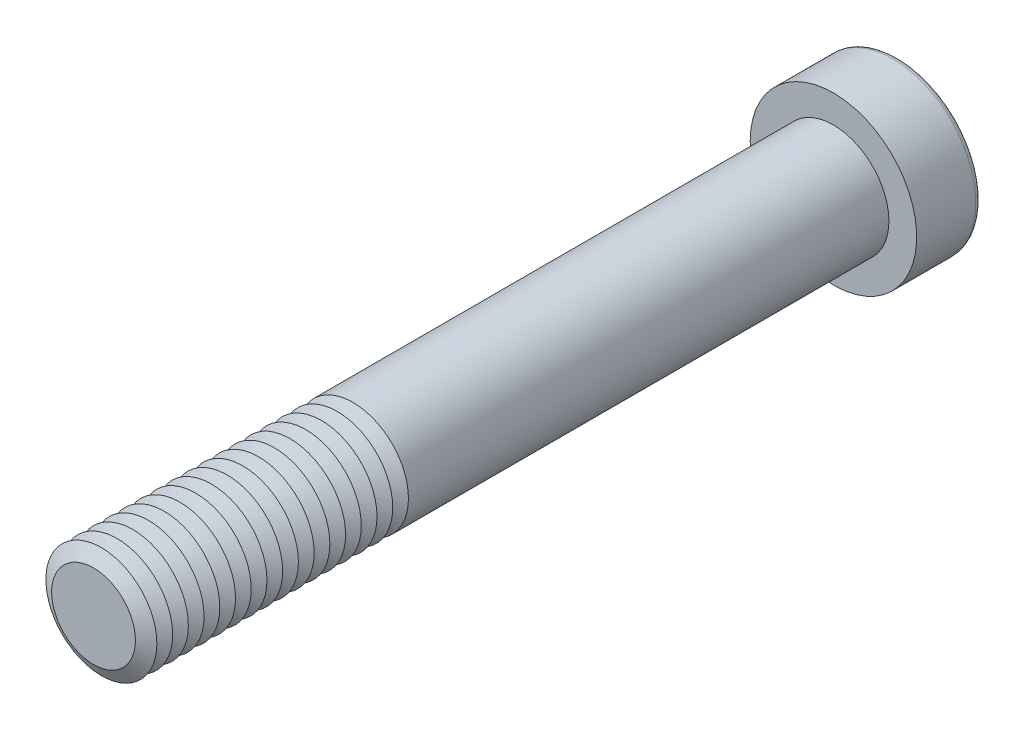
ISO-10303-21;
HEADER;
FILE_DESCRIPTION(('STEP AP214'),'2;1');
FILE_NAME('part.step','',(''),(''),'','','');
FILE_SCHEMA(('AUTOMOTIVE_DESIGN { 1 0 10303 214 1 1 1 1 }'));
ENDSEC;
DATA;
#1=APPLICATION_CONTEXT('core data for automotive mechanical design processes');
#2=APPLICATION_PROTOCOL_DEFINITION('international standard','automotive_design',2000,#1);
#3=PRODUCT_CONTEXT('',#1,'mechanical');
#4=PRODUCT('Part','Part','',(#3));
#5=PRODUCT_RELATED_PRODUCT_CATEGORY('part','',(#4));
#6=PRODUCT_DEFINITION_FORMATION('','',#4);
#7=PRODUCT_DEFINITION_CONTEXT('part definition',#1,'design');
#8=PRODUCT_DEFINITION('design','',#6,#7);
#9=PRODUCT_DEFINITION_SHAPE('','',#8);
#10=(LENGTH_UNIT() NAMED_UNIT(*) SI_UNIT(.MILLI.,.METRE.));
#11=(NAMED_UNIT(*) PLANE_ANGLE_UNIT() SI_UNIT($,.RADIAN.));
#12=(NAMED_UNIT(*) SI_UNIT($,.STERADIAN.) SOLID_ANGLE_UNIT());
#13=UNCERTAINTY_MEASURE_WITH_UNIT(LENGTH_MEASURE(1.E-05),#10,'distance_accuracy_value','');
#14=(GEOMETRIC_REPRESENTATION_CONTEXT(3) GLOBAL_UNCERTAINTY_ASSIGNED_CONTEXT((#13)) GLOBAL_UNIT_ASSIGNED_CONTEXT((#10,
#11,#12)) REPRESENTATION_CONTEXT('',''));
#15=CARTESIAN_POINT('',(0.,0.,0.));
#16=DIRECTION('',(0.,0.,1.));
#17=DIRECTION('',(1.,0.,0.));
#18=AXIS2_PLACEMENT_3D('',#15,#16,#17);
#19=CARTESIAN_POINT('',(0.,0.,74.05));
#20=DIRECTION('',(0.,0.,1.));
#21=DIRECTION('',(1.,0.,0.));
#22=AXIS2_PLACEMENT_3D('',#19,#20,#21);
#23=CONICAL_SURFACE('',#22,6.,1.0471975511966);
#24=CARTESIAN_POINT('',(0.,0.,73.2));
#25=DIRECTION('',(0.,0.,1.));
#26=DIRECTION('',(1.,0.,0.));
#27=AXIS2_PLACEMENT_3D('',#24,#25,#26);
#28=CIRCLE('',#27,4.52775681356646);
#29=CARTESIAN_POINT('',(4.52775681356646,0.,73.2));
#30=VERTEX_POINT('',#29);
#31=EDGE_CURVE('E312',#30,#30,#28,.T.);
#32=ORIENTED_EDGE('',*,*,#31,.T.);
#33=EDGE_LOOP('',(#32));
#34=FACE_BOUND('',#33,.T.);
#35=CARTESIAN_POINT('',(0.,0.,74.05));
#36=DIRECTION('',(0.,0.,1.));
#37=DIRECTION('',(1.,0.,0.));
#38=AXIS2_PLACEMENT_3D('',#35,#36,#37);
#39=CIRCLE('',#38,6.);
#40=CARTESIAN_POINT('',(6.,0.,74.05));
#41=VERTEX_POINT('',#40);
#42=EDGE_CURVE('E315',#41,#41,#39,.T.);
#43=ORIENTED_EDGE('',*,*,#42,.F.);
#44=EDGE_LOOP('',(#43));
#45=FACE_BOUND('',#44,.T.);
#46=ADVANCED_FACE('F39',(#34,#45),#23,.T.);
#47=CARTESIAN_POINT('',(0.,0.,73.2));
#48=DIRECTION('',(0.,0.,-1.));
#49=DIRECTION('',(-1.,0.,0.));
#50=AXIS2_PLACEMENT_3D('',#47,#48,#49);
#51=CONICAL_SURFACE('',#50,4.52775681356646,1.04719755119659);
#52=CARTESIAN_POINT('',(0.,0.,72.35));
#53=DIRECTION('',(0.,0.,1.));
#54=DIRECTION('',(1.,0.,0.));
#55=AXIS2_PLACEMENT_3D('',#52,#53,#54);
#56=CIRCLE('',#55,6.);
#57=CARTESIAN_POINT('',(6.,0.,72.35));
#58=VERTEX_POINT('',#57);
#59=EDGE_CURVE('E323',#58,#58,#56,.T.);
#60=ORIENTED_EDGE('',*,*,#59,.T.);
#61=EDGE_LOOP('',(#60));
#62=FACE_BOUND('',#61,.T.);
#63=ORIENTED_EDGE('',*,*,#31,.F.);
#64=EDGE_LOOP('',(#63));
#65=FACE_BOUND('',#64,.T.);
#66=ADVANCED_FACE('F244',(#62,#65),#51,.T.);
#67=CARTESIAN_POINT('',(0.,0.,80.));
#68=DIRECTION('',(0.,0.,1.));
#69=DIRECTION('',(1.,0.,0.));
#70=AXIS2_PLACEMENT_3D('',#67,#68,#69);
#71=PLANE('',#70);
#72=CARTESIAN_POINT('',(0.,0.,80.));
#73=DIRECTION('',(0.,0.,1.));
#74=DIRECTION('',(1.,0.,0.));
#75=AXIS2_PLACEMENT_3D('',#72,#73,#74);
#76=CIRCLE('',#75,4.52775681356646);
#77=CARTESIAN_POINT('',(4.52775681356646,0.,80.));
#78=VERTEX_POINT('',#77);
#79=EDGE_CURVE('E174',#78,#78,#76,.T.);
#80=ORIENTED_EDGE('',*,*,#79,.T.);
#81=EDGE_LOOP('',(#80));
#82=FACE_BOUND('',#81,.T.);
#83=ADVANCED_FACE('F250',(#82),#71,.T.);
#84=CARTESIAN_POINT('',(0.,0.,80.));
#85=DIRECTION('',(0.,0.,-1.));
#86=DIRECTION('',(-1.,0.,0.));
#87=AXIS2_PLACEMENT_3D('',#84,#85,#86);
#88=CONICAL_SURFACE('',#87,4.52775681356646,1.04719755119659);
#89=CARTESIAN_POINT('',(0.,0.,79.15));
#90=DIRECTION('',(0.,0.,1.));
#91=DIRECTION('',(1.,0.,0.));
#92=AXIS2_PLACEMENT_3D('',#89,#90,#91);
#93=CIRCLE('',#92,6.);
#94=CARTESIAN_POINT('',(6.,0.,79.15));
#95=VERTEX_POINT('',#94);
#96=EDGE_CURVE('E290',#95,#95,#93,.T.);
#97=ORIENTED_EDGE('',*,*,#96,.T.);
#98=EDGE_LOOP('',(#97));
#99=FACE_BOUND('',#98,.T.);
#100=ORIENTED_EDGE('',*,*,#79,.F.);
#101=EDGE_LOOP('',(#100));
#102=FACE_BOUND('',#101,.T.);
#103=ADVANCED_FACE('F198',(#99,#102),#88,.T.);
#104=CARTESIAN_POINT('',(0.,0.,79.15));
#105=DIRECTION('',(0.,0.,1.));
#106=DIRECTION('',(1.,0.,0.));
#107=AXIS2_PLACEMENT_3D('',#104,#105,#106);
#108=CONICAL_SURFACE('',#107,6.,1.0471975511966);
#109=CARTESIAN_POINT('',(0.,0.,78.3));
#110=DIRECTION('',(0.,0.,1.));
#111=DIRECTION('',(1.,0.,0.));
#112=AXIS2_PLACEMENT_3D('',#109,#110,#111);
#113=CIRCLE('',#112,4.52775681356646);
#114=CARTESIAN_POINT('',(4.52775681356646,0.,78.3));
#115=VERTEX_POINT('',#114);
#116=EDGE_CURVE('E287',#115,#115,#113,.T.);
#117=ORIENTED_EDGE('',*,*,#116,.T.);
#118=EDGE_LOOP('',(#117));
#119=FACE_BOUND('',#118,.T.);
#120=ORIENTED_EDGE('',*,*,#96,.F.);
#121=EDGE_LOOP('',(#120));
#122=FACE_BOUND('',#121,.T.);
#123=ADVANCED_FACE('F276',(#119,#122),#108,.T.);
#124=CARTESIAN_POINT('',(0.,0.,78.3));
#125=DIRECTION('',(0.,0.,-1.));
#126=DIRECTION('',(-1.,0.,0.));
#127=AXIS2_PLACEMENT_3D('',#124,#125,#126);
#128=CONICAL_SURFACE('',#127,4.52775681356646,1.04719755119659);
#129=CARTESIAN_POINT('',(0.,0.,77.45));
#130=DIRECTION('',(0.,0.,1.));
#131=DIRECTION('',(1.,0.,0.));
#132=AXIS2_PLACEMENT_3D('',#129,#130,#131);
#133=CIRCLE('',#132,6.);
#134=CARTESIAN_POINT('',(6.,0.,77.45));
#135=VERTEX_POINT('',#134);
#136=EDGE_CURVE('E298',#135,#135,#133,.T.);
#137=ORIENTED_EDGE('',*,*,#136,.T.);
#138=EDGE_LOOP('',(#137));
#139=FACE_BOUND('',#138,.T.);
#140=ORIENTED_EDGE('',*,*,#116,.F.);
#141=EDGE_LOOP('',(#140));
#142=FACE_BOUND('',#141,.T.);
#143=ADVANCED_FACE('F273',(#139,#142),#128,.T.);
#144=CARTESIAN_POINT('',(0.,0.,77.45));
#145=DIRECTION('',(0.,0.,1.));
#146=DIRECTION('',(1.,0.,0.));
#147=AXIS2_PLACEMENT_3D('',#144,#145,#146);
#148=CONICAL_SURFACE('',#147,6.,1.0471975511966);
#149=CARTESIAN_POINT('',(0.,0.,76.6));
#150=DIRECTION('',(0.,0.,1.));
#151=DIRECTION('',(1.,0.,0.));
#152=AXIS2_PLACEMENT_3D('',#149,#150,#151);
#153=CIRCLE('',#152,4.52775681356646);
#154=CARTESIAN_POINT('',(4.52775681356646,0.,76.6));
#155=VERTEX_POINT('',#154);
#156=EDGE_CURVE('E292',#155,#155,#153,.T.);
#157=ORIENTED_EDGE('',*,*,#156,.T.);
#158=EDGE_LOOP('',(#157));
#159=FACE_BOUND('',#158,.T.);
#160=ORIENTED_EDGE('',*,*,#136,.F.);
#161=EDGE_LOOP('',(#160));
#162=FACE_BOUND('',#161,.T.);
#163=ADVANCED_FACE('F269',(#159,#162),#148,.T.);
#164=CARTESIAN_POINT('',(0.,0.,76.6));
#165=DIRECTION('',(0.,0.,-1.));
#166=DIRECTION('',(-1.,0.,0.));
#167=AXIS2_PLACEMENT_3D('',#164,#165,#166);
#168=CONICAL_SURFACE('',#167,4.52775681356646,1.04719755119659);
#169=CARTESIAN_POINT('',(0.,0.,75.75));
#170=DIRECTION('',(0.,0.,1.));
#171=DIRECTION('',(1.,0.,0.));
#172=AXIS2_PLACEMENT_3D('',#169,#170,#171);
#173=CIRCLE('',#172,6.);
#174=CARTESIAN_POINT('',(6.,0.,75.75));
#175=VERTEX_POINT('',#174);
#176=EDGE_CURVE('E308',#175,#175,#173,.T.);
#177=ORIENTED_EDGE('',*,*,#176,.T.);
#178=EDGE_LOOP('',(#177));
#179=FACE_BOUND('',#178,.T.);
#180=ORIENTED_EDGE('',*,*,#156,.F.);
#181=EDGE_LOOP('',(#180));
#182=FACE_BOUND('',#181,.T.);
#183=ADVANCED_FACE('F265',(#179,#182),#168,.T.);
#184=CARTESIAN_POINT('',(0.,0.,75.75));
#185=DIRECTION('',(0.,0.,1.));
#186=DIRECTION('',(1.,0.,0.));
#187=AXIS2_PLACEMENT_3D('',#184,#185,#186);
#188=CONICAL_SURFACE('',#187,6.,1.0471975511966);
#189=CARTESIAN_POINT('',(0.,0.,74.9));
#190=DIRECTION('',(0.,0.,1.));
#191=DIRECTION('',(1.,0.,0.));
#192=AXIS2_PLACEMENT_3D('',#189,#190,#191);
#193=CIRCLE('',#192,4.52775681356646);
#194=CARTESIAN_POINT('',(4.52775681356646,0.,74.9));
#195=VERTEX_POINT('',#194);
#196=EDGE_CURVE('E304',#195,#195,#193,.T.);
#197=ORIENTED_EDGE('',*,*,#196,.T.);
#198=EDGE_LOOP('',(#197));
#199=FACE_BOUND('',#198,.T.);
#200=ORIENTED_EDGE('',*,*,#176,.F.);
#201=EDGE_LOOP('',(#200));
#202=FACE_BOUND('',#201,.T.);
#203=ADVANCED_FACE('F261',(#199,#202),#188,.T.);
#204=CARTESIAN_POINT('',(0.,0.,74.9));
#205=DIRECTION('',(0.,0.,-1.));
#206=DIRECTION('',(-1.,0.,0.));
#207=AXIS2_PLACEMENT_3D('',#204,#205,#206);
#208=CONICAL_SURFACE('',#207,4.52775681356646,1.04719755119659);
#209=ORIENTED_EDGE('',*,*,#42,.T.);
#210=EDGE_LOOP('',(#209));
#211=FACE_BOUND('',#210,.T.);
#212=ORIENTED_EDGE('',*,*,#196,.F.);
#213=EDGE_LOOP('',(#212));
#214=FACE_BOUND('',#213,.T.);
#215=ADVANCED_FACE('F257',(#211,#214),#208,.T.);
#216=CARTESIAN_POINT('',(0.,0.,72.35));
#217=DIRECTION('',(0.,0.,1.));
#218=DIRECTION('',(1.,0.,0.));
#219=AXIS2_PLACEMENT_3D('',#216,#217,#218);
#220=CONICAL_SURFACE('',#219,6.,1.0471975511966);
#221=CARTESIAN_POINT('',(0.,0.,71.5));
#222=DIRECTION('',(0.,0.,1.));
#223=DIRECTION('',(1.,0.,0.));
#224=AXIS2_PLACEMENT_3D('',#221,#222,#223);
#225=CIRCLE('',#224,4.52775681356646);
#226=CARTESIAN_POINT('',(4.52775681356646,0.,71.5));
#227=VERTEX_POINT('',#226);
#228=EDGE_CURVE('E319',#227,#227,#225,.T.);
#229=ORIENTED_EDGE('',*,*,#228,.T.);
#230=EDGE_LOOP('',(#229));
#231=FACE_BOUND('',#230,.T.);
#232=ORIENTED_EDGE('',*,*,#59,.F.);
#233=EDGE_LOOP('',(#232));
#234=FACE_BOUND('',#233,.T.);
#235=ADVANCED_FACE('F260',(#231,#234),#220,.T.);
#236=CARTESIAN_POINT('',(0.,0.,71.5));
#237=DIRECTION('',(0.,0.,-1.));
#238=DIRECTION('',(-1.,0.,0.));
#239=AXIS2_PLACEMENT_3D('',#236,#237,#238);
#240=CONICAL_SURFACE('',#239,4.52775681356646,1.04719755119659);
#241=CARTESIAN_POINT('',(0.,0.,70.65));
#242=DIRECTION('',(0.,0.,1.));
#243=DIRECTION('',(1.,0.,0.));
#244=AXIS2_PLACEMENT_3D('',#241,#242,#243);
#245=CIRCLE('',#244,6.);
#246=CARTESIAN_POINT('',(6.,0.,70.65));
#247=VERTEX_POINT('',#246);
#248=EDGE_CURVE('E331',#247,#247,#245,.T.);
#249=ORIENTED_EDGE('',*,*,#248,.T.);
#250=EDGE_LOOP('',(#249));
#251=FACE_BOUND('',#250,.T.);
#252=ORIENTED_EDGE('',*,*,#228,.F.);
#253=EDGE_LOOP('',(#252));
#254=FACE_BOUND('',#253,.T.);
#255=ADVANCED_FACE('F510',(#251,#254),#240,.T.);
#256=CARTESIAN_POINT('',(0.,0.,70.65));
#257=DIRECTION('',(0.,0.,1.));
#258=DIRECTION('',(1.,0.,0.));
#259=AXIS2_PLACEMENT_3D('',#256,#257,#258);
#260=CONICAL_SURFACE('',#259,6.,1.0471975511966);
#261=CARTESIAN_POINT('',(0.,0.,69.8));
#262=DIRECTION('',(0.,0.,1.));
#263=DIRECTION('',(1.,0.,0.));
#264=AXIS2_PLACEMENT_3D('',#261,#262,#263);
#265=CIRCLE('',#264,4.52775681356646);
#266=CARTESIAN_POINT('',(4.52775681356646,0.,69.8));
#267=VERTEX_POINT('',#266);
#268=EDGE_CURVE('E327',#267,#267,#265,.T.);
#269=ORIENTED_EDGE('',*,*,#268,.T.);
#270=EDGE_LOOP('',(#269));
#271=FACE_BOUND('',#270,.T.);
#272=ORIENTED_EDGE('',*,*,#248,.F.);
#273=EDGE_LOOP('',(#272));
#274=FACE_BOUND('',#273,.T.);
#275=ADVANCED_FACE('F506',(#271,#274),#260,.T.);
#276=CARTESIAN_POINT('',(0.,0.,69.8));
#277=DIRECTION('',(0.,0.,-1.));
#278=DIRECTION('',(-1.,0.,0.));
#279=AXIS2_PLACEMENT_3D('',#276,#277,#278);
#280=CONICAL_SURFACE('',#279,4.52775681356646,1.04719755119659);
#281=CARTESIAN_POINT('',(0.,0.,68.95));
#282=DIRECTION('',(0.,0.,1.));
#283=DIRECTION('',(1.,0.,0.));
#284=AXIS2_PLACEMENT_3D('',#281,#282,#283);
#285=CIRCLE('',#284,6.);
#286=CARTESIAN_POINT('',(6.,0.,68.95));
#287=VERTEX_POINT('',#286);
#288=EDGE_CURVE('E338',#287,#287,#285,.T.);
#289=ORIENTED_EDGE('',*,*,#288,.T.);
#290=EDGE_LOOP('',(#289));
#291=FACE_BOUND('',#290,.T.);
#292=ORIENTED_EDGE('',*,*,#268,.F.);
#293=EDGE_LOOP('',(#292));
#294=FACE_BOUND('',#293,.T.);
#295=ADVANCED_FACE('F502',(#291,#294),#280,.T.);
#296=CARTESIAN_POINT('',(0.,0.,68.95));
#297=DIRECTION('',(0.,0.,1.));
#298=DIRECTION('',(1.,0.,0.));
#299=AXIS2_PLACEMENT_3D('',#296,#297,#298);
#300=CONICAL_SURFACE('',#299,6.,1.0471975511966);
#301=CARTESIAN_POINT('',(0.,0.,68.1));
#302=DIRECTION('',(0.,0.,1.));
#303=DIRECTION('',(1.,0.,0.));
#304=AXIS2_PLACEMENT_3D('',#301,#302,#303);
#305=CIRCLE('',#304,4.52775681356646);
#306=CARTESIAN_POINT('',(4.52775681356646,0.,68.1));
#307=VERTEX_POINT('',#306);
#308=EDGE_CURVE('E334',#307,#307,#305,.T.);
#309=ORIENTED_EDGE('',*,*,#308,.T.);
#310=EDGE_LOOP('',(#309));
#311=FACE_BOUND('',#310,.T.);
#312=ORIENTED_EDGE('',*,*,#288,.F.);
#313=EDGE_LOOP('',(#312));
#314=FACE_BOUND('',#313,.T.);
#315=ADVANCED_FACE('F498',(#311,#314),#300,.T.);
#316=CARTESIAN_POINT('',(0.,0.,68.1));
#317=DIRECTION('',(0.,0.,-1.));
#318=DIRECTION('',(-1.,0.,0.));
#319=AXIS2_PLACEMENT_3D('',#316,#317,#318);
#320=CONICAL_SURFACE('',#319,4.52775681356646,1.04719755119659);
#321=CARTESIAN_POINT('',(0.,0.,67.25));
#322=DIRECTION('',(0.,0.,1.));
#323=DIRECTION('',(1.,0.,0.));
#324=AXIS2_PLACEMENT_3D('',#321,#322,#323);
#325=CIRCLE('',#324,6.);
#326=CARTESIAN_POINT('',(6.,0.,67.25));
#327=VERTEX_POINT('',#326);
#328=EDGE_CURVE('E346',#327,#327,#325,.T.);
#329=ORIENTED_EDGE('',*,*,#328,.T.);
#330=EDGE_LOOP('',(#329));
#331=FACE_BOUND('',#330,.T.);
#332=ORIENTED_EDGE('',*,*,#308,.F.);
#333=EDGE_LOOP('',(#332));
#334=FACE_BOUND('',#333,.T.);
#335=ADVANCED_FACE('F494',(#331,#334),#320,.T.);
#336=CARTESIAN_POINT('',(0.,0.,67.25));
#337=DIRECTION('',(0.,0.,1.));
#338=DIRECTION('',(1.,0.,0.));
#339=AXIS2_PLACEMENT_3D('',#336,#337,#338);
#340=CONICAL_SURFACE('',#339,6.,1.0471975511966);
#341=CARTESIAN_POINT('',(0.,0.,66.4));
#342=DIRECTION('',(0.,0.,1.));
#343=DIRECTION('',(1.,0.,0.));
#344=AXIS2_PLACEMENT_3D('',#341,#342,#343);
#345=CIRCLE('',#344,4.52775681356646);
#346=CARTESIAN_POINT('',(4.52775681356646,0.,66.4));
#347=VERTEX_POINT('',#346);
#348=EDGE_CURVE('E342',#347,#347,#345,.T.);
#349=ORIENTED_EDGE('',*,*,#348,.T.);
#350=EDGE_LOOP('',(#349));
#351=FACE_BOUND('',#350,.T.);
#352=ORIENTED_EDGE('',*,*,#328,.F.);
#353=EDGE_LOOP('',(#352));
#354=FACE_BOUND('',#353,.T.);
#355=ADVANCED_FACE('F490',(#351,#354),#340,.T.);
#356=CARTESIAN_POINT('',(0.,0.,66.4));
#357=DIRECTION('',(0.,0.,-1.));
#358=DIRECTION('',(-1.,0.,0.));
#359=AXIS2_PLACEMENT_3D('',#356,#357,#358);
#360=CONICAL_SURFACE('',#359,4.52775681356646,1.04719755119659);
#361=CARTESIAN_POINT('',(0.,0.,65.55));
#362=DIRECTION('',(0.,0.,1.));
#363=DIRECTION('',(1.,0.,0.));
#364=AXIS2_PLACEMENT_3D('',#361,#362,#363);
#365=CIRCLE('',#364,6.);
#366=CARTESIAN_POINT('',(6.,0.,65.55));
#367=VERTEX_POINT('',#366);
#368=EDGE_CURVE('E354',#367,#367,#365,.T.);
#369=ORIENTED_EDGE('',*,*,#368,.T.);
#370=EDGE_LOOP('',(#369));
#371=FACE_BOUND('',#370,.T.);
#372=ORIENTED_EDGE('',*,*,#348,.F.);
#373=EDGE_LOOP('',(#372));
#374=FACE_BOUND('',#373,.T.);
#375=ADVANCED_FACE('F486',(#371,#374),#360,.T.);
#376=CARTESIAN_POINT('',(0.,0.,65.55));
#377=DIRECTION('',(0.,0.,1.));
#378=DIRECTION('',(1.,0.,0.));
#379=AXIS2_PLACEMENT_3D('',#376,#377,#378);
#380=CONICAL_SURFACE('',#379,6.,1.0471975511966);
#381=CARTESIAN_POINT('',(0.,0.,64.7));
#382=DIRECTION('',(0.,0.,1.));
#383=DIRECTION('',(1.,0.,0.));
#384=AXIS2_PLACEMENT_3D('',#381,#382,#383);
#385=CIRCLE('',#384,4.52775681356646);
#386=CARTESIAN_POINT('',(4.52775681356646,0.,64.7));
#387=VERTEX_POINT('',#386);
#388=EDGE_CURVE('E350',#387,#387,#385,.T.);
#389=ORIENTED_EDGE('',*,*,#388,.T.);
#390=EDGE_LOOP('',(#389));
#391=FACE_BOUND('',#390,.T.);
#392=ORIENTED_EDGE('',*,*,#368,.F.);
#393=EDGE_LOOP('',(#392));
#394=FACE_BOUND('',#393,.T.);
#395=ADVANCED_FACE('F482',(#391,#394),#380,.T.);
#396=CARTESIAN_POINT('',(0.,0.,64.7));
#397=DIRECTION('',(0.,0.,-1.));
#398=DIRECTION('',(-1.,0.,0.));
#399=AXIS2_PLACEMENT_3D('',#396,#397,#398);
#400=CONICAL_SURFACE('',#399,4.52775681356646,1.04719755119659);
#401=CARTESIAN_POINT('',(0.,0.,63.85));
#402=DIRECTION('',(0.,0.,1.));
#403=DIRECTION('',(1.,0.,0.));
#404=AXIS2_PLACEMENT_3D('',#401,#402,#403);
#405=CIRCLE('',#404,6.);
#406=CARTESIAN_POINT('',(6.,0.,63.85));
#407=VERTEX_POINT('',#406);
#408=EDGE_CURVE('E362',#407,#407,#405,.T.);
#409=ORIENTED_EDGE('',*,*,#408,.T.);
#410=EDGE_LOOP('',(#409));
#411=FACE_BOUND('',#410,.T.);
#412=ORIENTED_EDGE('',*,*,#388,.F.);
#413=EDGE_LOOP('',(#412));
#414=FACE_BOUND('',#413,.T.);
#415=ADVANCED_FACE('F478',(#411,#414),#400,.T.);
#416=CARTESIAN_POINT('',(0.,0.,63.85));
#417=DIRECTION('',(0.,0.,1.));
#418=DIRECTION('',(1.,0.,0.));
#419=AXIS2_PLACEMENT_3D('',#416,#417,#418);
#420=CONICAL_SURFACE('',#419,6.,1.0471975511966);
#421=CARTESIAN_POINT('',(0.,0.,63.));
#422=DIRECTION('',(0.,0.,1.));
#423=DIRECTION('',(1.,0.,0.));
#424=AXIS2_PLACEMENT_3D('',#421,#422,#423);
#425=CIRCLE('',#424,4.52775681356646);
#426=CARTESIAN_POINT('',(4.52775681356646,0.,63.));
#427=VERTEX_POINT('',#426);
#428=EDGE_CURVE('E358',#427,#427,#425,.T.);
#429=ORIENTED_EDGE('',*,*,#428,.T.);
#430=EDGE_LOOP('',(#429));
#431=FACE_BOUND('',#430,.T.);
#432=ORIENTED_EDGE('',*,*,#408,.F.);
#433=EDGE_LOOP('',(#432));
#434=FACE_BOUND('',#433,.T.);
#435=ADVANCED_FACE('F474',(#431,#434),#420,.T.);
#436=CARTESIAN_POINT('',(0.,0.,63.));
#437=DIRECTION('',(0.,0.,-1.));
#438=DIRECTION('',(-1.,0.,0.));
#439=AXIS2_PLACEMENT_3D('',#436,#437,#438);
#440=CONICAL_SURFACE('',#439,4.52775681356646,1.04719755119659);
#441=CARTESIAN_POINT('',(0.,0.,62.15));
#442=DIRECTION('',(0.,0.,1.));
#443=DIRECTION('',(1.,0.,0.));
#444=AXIS2_PLACEMENT_3D('',#441,#442,#443);
#445=CIRCLE('',#444,6.);
#446=CARTESIAN_POINT('',(6.,0.,62.15));
#447=VERTEX_POINT('',#446);
#448=EDGE_CURVE('E370',#447,#447,#445,.T.);
#449=ORIENTED_EDGE('',*,*,#448,.T.);
#450=EDGE_LOOP('',(#449));
#451=FACE_BOUND('',#450,.T.);
#452=ORIENTED_EDGE('',*,*,#428,.F.);
#453=EDGE_LOOP('',(#452));
#454=FACE_BOUND('',#453,.T.);
#455=ADVANCED_FACE('F470',(#451,#454),#440,.T.);
#456=CARTESIAN_POINT('',(0.,0.,62.15));
#457=DIRECTION('',(0.,0.,1.));
#458=DIRECTION('',(1.,0.,0.));
#459=AXIS2_PLACEMENT_3D('',#456,#457,#458);
#460=CONICAL_SURFACE('',#459,6.,1.0471975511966);
#461=CARTESIAN_POINT('',(0.,0.,61.3));
#462=DIRECTION('',(0.,0.,1.));
#463=DIRECTION('',(1.,0.,0.));
#464=AXIS2_PLACEMENT_3D('',#461,#462,#463);
#465=CIRCLE('',#464,4.52775681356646);
#466=CARTESIAN_POINT('',(4.52775681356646,0.,61.3));
#467=VERTEX_POINT('',#466);
#468=EDGE_CURVE('E366',#467,#467,#465,.T.);
#469=ORIENTED_EDGE('',*,*,#468,.T.);
#470=EDGE_LOOP('',(#469));
#471=FACE_BOUND('',#470,.T.);
#472=ORIENTED_EDGE('',*,*,#448,.F.);
#473=EDGE_LOOP('',(#472));
#474=FACE_BOUND('',#473,.T.);
#475=ADVANCED_FACE('F466',(#471,#474),#460,.T.);
#476=CARTESIAN_POINT('',(0.,0.,61.3));
#477=DIRECTION('',(0.,0.,-1.));
#478=DIRECTION('',(-1.,0.,0.));
#479=AXIS2_PLACEMENT_3D('',#476,#477,#478);
#480=CONICAL_SURFACE('',#479,4.52775681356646,1.04719755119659);
#481=CARTESIAN_POINT('',(0.,0.,60.45));
#482=DIRECTION('',(0.,0.,1.));
#483=DIRECTION('',(1.,0.,0.));
#484=AXIS2_PLACEMENT_3D('',#481,#482,#483);
#485=CIRCLE('',#484,6.);
#486=CARTESIAN_POINT('',(6.,0.,60.45));
#487=VERTEX_POINT('',#486);
#488=EDGE_CURVE('E378',#487,#487,#485,.T.);
#489=ORIENTED_EDGE('',*,*,#488,.T.);
#490=EDGE_LOOP('',(#489));
#491=FACE_BOUND('',#490,.T.);
#492=ORIENTED_EDGE('',*,*,#468,.F.);
#493=EDGE_LOOP('',(#492));
#494=FACE_BOUND('',#493,.T.);
#495=ADVANCED_FACE('F462',(#491,#494),#480,.T.);
#496=CARTESIAN_POINT('',(0.,0.,60.45));
#497=DIRECTION('',(0.,0.,1.));
#498=DIRECTION('',(1.,0.,0.));
#499=AXIS2_PLACEMENT_3D('',#496,#497,#498);
#500=CONICAL_SURFACE('',#499,6.,1.0471975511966);
#501=CARTESIAN_POINT('',(0.,0.,59.6));
#502=DIRECTION('',(0.,0.,1.));
#503=DIRECTION('',(1.,0.,0.));
#504=AXIS2_PLACEMENT_3D('',#501,#502,#503);
#505=CIRCLE('',#504,4.52775681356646);
#506=CARTESIAN_POINT('',(4.52775681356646,0.,59.6));
#507=VERTEX_POINT('',#506);
#508=EDGE_CURVE('E374',#507,#507,#505,.T.);
#509=ORIENTED_EDGE('',*,*,#508,.T.);
#510=EDGE_LOOP('',(#509));
#511=FACE_BOUND('',#510,.T.);
#512=ORIENTED_EDGE('',*,*,#488,.F.);
#513=EDGE_LOOP('',(#512));
#514=FACE_BOUND('',#513,.T.);
#515=ADVANCED_FACE('F458',(#511,#514),#500,.T.);
#516=CARTESIAN_POINT('',(0.,0.,59.6));
#517=DIRECTION('',(0.,0.,-1.));
#518=DIRECTION('',(-1.,0.,0.));
#519=AXIS2_PLACEMENT_3D('',#516,#517,#518);
#520=CONICAL_SURFACE('',#519,4.52775681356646,1.04719755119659);
#521=CARTESIAN_POINT('',(0.,0.,58.75));
#522=DIRECTION('',(0.,0.,1.));
#523=DIRECTION('',(1.,0.,0.));
#524=AXIS2_PLACEMENT_3D('',#521,#522,#523);
#525=CIRCLE('',#524,6.);
#526=CARTESIAN_POINT('',(6.,0.,58.75));
#527=VERTEX_POINT('',#526);
#528=EDGE_CURVE('E386',#527,#527,#525,.T.);
#529=ORIENTED_EDGE('',*,*,#528,.T.);
#530=EDGE_LOOP('',(#529));
#531=FACE_BOUND('',#530,.T.);
#532=ORIENTED_EDGE('',*,*,#508,.F.);
#533=EDGE_LOOP('',(#532));
#534=FACE_BOUND('',#533,.T.);
#535=ADVANCED_FACE('F454',(#531,#534),#520,.T.);
#536=CARTESIAN_POINT('',(0.,0.,58.75));
#537=DIRECTION('',(0.,0.,1.));
#538=DIRECTION('',(1.,0.,0.));
#539=AXIS2_PLACEMENT_3D('',#536,#537,#538);
#540=CONICAL_SURFACE('',#539,6.,1.0471975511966);
#541=CARTESIAN_POINT('',(0.,0.,57.9));
#542=DIRECTION('',(0.,0.,1.));
#543=DIRECTION('',(1.,0.,0.));
#544=AXIS2_PLACEMENT_3D('',#541,#542,#543);
#545=CIRCLE('',#544,4.52775681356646);
#546=CARTESIAN_POINT('',(4.52775681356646,0.,57.9));
#547=VERTEX_POINT('',#546);
#548=EDGE_CURVE('E382',#547,#547,#545,.T.);
#549=ORIENTED_EDGE('',*,*,#548,.T.);
#550=EDGE_LOOP('',(#549));
#551=FACE_BOUND('',#550,.T.);
#552=ORIENTED_EDGE('',*,*,#528,.F.);
#553=EDGE_LOOP('',(#552));
#554=FACE_BOUND('',#553,.T.);
#555=ADVANCED_FACE('F450',(#551,#554),#540,.T.);
#556=CARTESIAN_POINT('',(0.,0.,57.9));
#557=DIRECTION('',(0.,0.,-1.));
#558=DIRECTION('',(-1.,0.,0.));
#559=AXIS2_PLACEMENT_3D('',#556,#557,#558);
#560=CONICAL_SURFACE('',#559,4.52775681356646,1.04719755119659);
#561=CARTESIAN_POINT('',(0.,0.,57.05));
#562=DIRECTION('',(0.,0.,1.));
#563=DIRECTION('',(1.,0.,0.));
#564=AXIS2_PLACEMENT_3D('',#561,#562,#563);
#565=CIRCLE('',#564,6.);
#566=CARTESIAN_POINT('',(6.,0.,57.05));
#567=VERTEX_POINT('',#566);
#568=EDGE_CURVE('E394',#567,#567,#565,.T.);
#569=ORIENTED_EDGE('',*,*,#568,.T.);
#570=EDGE_LOOP('',(#569));
#571=FACE_BOUND('',#570,.T.);
#572=ORIENTED_EDGE('',*,*,#548,.F.);
#573=EDGE_LOOP('',(#572));
#574=FACE_BOUND('',#573,.T.);
#575=ADVANCED_FACE('F446',(#571,#574),#560,.T.);
#576=CARTESIAN_POINT('',(0.,0.,57.05));
#577=DIRECTION('',(0.,0.,1.));
#578=DIRECTION('',(1.,0.,0.));
#579=AXIS2_PLACEMENT_3D('',#576,#577,#578);
#580=CONICAL_SURFACE('',#579,6.,1.0471975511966);
#581=CARTESIAN_POINT('',(0.,0.,56.2));
#582=DIRECTION('',(0.,0.,1.));
#583=DIRECTION('',(1.,0.,0.));
#584=AXIS2_PLACEMENT_3D('',#581,#582,#583);
#585=CIRCLE('',#584,4.52775681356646);
#586=CARTESIAN_POINT('',(4.52775681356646,0.,56.2));
#587=VERTEX_POINT('',#586);
#588=EDGE_CURVE('E390',#587,#587,#585,.T.);
#589=ORIENTED_EDGE('',*,*,#588,.T.);
#590=EDGE_LOOP('',(#589));
#591=FACE_BOUND('',#590,.T.);
#592=ORIENTED_EDGE('',*,*,#568,.F.);
#593=EDGE_LOOP('',(#592));
#594=FACE_BOUND('',#593,.T.);
#595=ADVANCED_FACE('F442',(#591,#594),#580,.T.);
#596=CARTESIAN_POINT('',(0.,0.,56.2));
#597=DIRECTION('',(0.,0.,-1.));
#598=DIRECTION('',(-1.,0.,0.));
#599=AXIS2_PLACEMENT_3D('',#596,#597,#598);
#600=CONICAL_SURFACE('',#599,4.52775681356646,1.04719755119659);
#601=CARTESIAN_POINT('',(0.,0.,55.35));
#602=DIRECTION('',(0.,0.,1.));
#603=DIRECTION('',(1.,0.,0.));
#604=AXIS2_PLACEMENT_3D('',#601,#602,#603);
#605=CIRCLE('',#604,6.);
#606=CARTESIAN_POINT('',(6.,0.,55.35));
#607=VERTEX_POINT('',#606);
#608=EDGE_CURVE('E402',#607,#607,#605,.T.);
#609=ORIENTED_EDGE('',*,*,#608,.T.);
#610=EDGE_LOOP('',(#609));
#611=FACE_BOUND('',#610,.T.);
#612=ORIENTED_EDGE('',*,*,#588,.F.);
#613=EDGE_LOOP('',(#612));
#614=FACE_BOUND('',#613,.T.);
#615=ADVANCED_FACE('F438',(#611,#614),#600,.T.);
#616=CARTESIAN_POINT('',(0.,0.,55.35));
#617=DIRECTION('',(0.,0.,1.));
#618=DIRECTION('',(1.,0.,0.));
#619=AXIS2_PLACEMENT_3D('',#616,#617,#618);
#620=CONICAL_SURFACE('',#619,6.,1.0471975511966);
#621=CARTESIAN_POINT('',(0.,0.,54.5));
#622=DIRECTION('',(0.,0.,1.));
#623=DIRECTION('',(1.,0.,0.));
#624=AXIS2_PLACEMENT_3D('',#621,#622,#623);
#625=CIRCLE('',#624,4.52775681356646);
#626=CARTESIAN_POINT('',(4.52775681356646,0.,54.5));
#627=VERTEX_POINT('',#626);
#628=EDGE_CURVE('E398',#627,#627,#625,.T.);
#629=ORIENTED_EDGE('',*,*,#628,.T.);
#630=EDGE_LOOP('',(#629));
#631=FACE_BOUND('',#630,.T.);
#632=ORIENTED_EDGE('',*,*,#608,.F.);
#633=EDGE_LOOP('',(#632));
#634=FACE_BOUND('',#633,.T.);
#635=ADVANCED_FACE('F433',(#631,#634),#620,.T.);
#636=CARTESIAN_POINT('',(0.,0.,54.5));
#637=DIRECTION('',(0.,0.,-1.));
#638=DIRECTION('',(-1.,0.,0.));
#639=AXIS2_PLACEMENT_3D('',#636,#637,#638);
#640=CONICAL_SURFACE('',#639,4.52775681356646,1.04719755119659);
#641=CARTESIAN_POINT('',(0.,0.,53.65));
#642=DIRECTION('',(0.,0.,1.));
#643=DIRECTION('',(1.,0.,0.));
#644=AXIS2_PLACEMENT_3D('',#641,#642,#643);
#645=CIRCLE('',#644,6.);
#646=CARTESIAN_POINT('',(6.,0.,53.65));
#647=VERTEX_POINT('',#646);
#648=EDGE_CURVE('E413',#647,#647,#645,.T.);
#649=ORIENTED_EDGE('',*,*,#648,.T.);
#650=EDGE_LOOP('',(#649));
#651=FACE_BOUND('',#650,.T.);
#652=ORIENTED_EDGE('',*,*,#628,.F.);
#653=EDGE_LOOP('',(#652));
#654=FACE_BOUND('',#653,.T.);
#655=ADVANCED_FACE('F419',(#651,#654),#640,.T.);
#656=CARTESIAN_POINT('',(0.,0.,53.65));
#657=DIRECTION('',(0.,0.,1.));
#658=DIRECTION('',(1.,0.,0.));
#659=AXIS2_PLACEMENT_3D('',#656,#657,#658);
#660=CONICAL_SURFACE('',#659,6.,1.0471975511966);
#661=CARTESIAN_POINT('',(0.,0.,52.8));
#662=DIRECTION('',(0.,0.,1.));
#663=DIRECTION('',(1.,0.,0.));
#664=AXIS2_PLACEMENT_3D('',#661,#662,#663);
#665=CIRCLE('',#664,4.52775681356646);
#666=CARTESIAN_POINT('',(4.52775681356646,0.,52.8));
#667=VERTEX_POINT('',#666);
#668=EDGE_CURVE('E405',#667,#667,#665,.T.);
#669=ORIENTED_EDGE('',*,*,#668,.T.);
#670=EDGE_LOOP('',(#669));
#671=FACE_BOUND('',#670,.T.);
#672=ORIENTED_EDGE('',*,*,#648,.F.);
#673=EDGE_LOOP('',(#672));
#674=FACE_BOUND('',#673,.T.);
#675=ADVANCED_FACE('F422',(#671,#674),#660,.T.);
#676=CARTESIAN_POINT('',(0.,0.,52.8));
#677=DIRECTION('',(0.,0.,-1.));
#678=DIRECTION('',(-1.,0.,0.));
#679=AXIS2_PLACEMENT_3D('',#676,#677,#678);
#680=CONICAL_SURFACE('',#679,4.52775681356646,1.04719755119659);
#681=CARTESIAN_POINT('',(0.,0.,51.95));
#682=DIRECTION('',(0.,0.,1.));
#683=DIRECTION('',(1.,0.,0.));
#684=AXIS2_PLACEMENT_3D('',#681,#682,#683);
#685=CIRCLE('',#684,6.);
#686=CARTESIAN_POINT('',(6.,0.,51.95));
#687=VERTEX_POINT('',#686);
#688=EDGE_CURVE('E409',#687,#687,#685,.T.);
#689=ORIENTED_EDGE('',*,*,#688,.T.);
#690=EDGE_LOOP('',(#689));
#691=FACE_BOUND('',#690,.T.);
#692=ORIENTED_EDGE('',*,*,#668,.F.);
#693=EDGE_LOOP('',(#692));
#694=FACE_BOUND('',#693,.T.);
#695=ADVANCED_FACE('F424',(#691,#694),#680,.T.);
#696=CARTESIAN_POINT('',(0.,0.,-1.));
#697=DIRECTION('',(0.,0.,-1.));
#698=DIRECTION('',(-1.,0.,0.));
#699=AXIS2_PLACEMENT_3D('',#696,#697,#698);
#700=CONICAL_SURFACE('',#699,4.,1.0471975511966);
#701=CARTESIAN_POINT('',(0.,0.,1.30940107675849));
#702=VERTEX_POINT('',#701);
#703=VERTEX_LOOP('',#702);
#704=FACE_BOUND('',#703,.T.);
#705=CARTESIAN_POINT('',(0.,0.,-1.));
#706=DIRECTION('',(0.,0.,-1.));
#707=DIRECTION('',(-1.,0.,0.));
#708=AXIS2_PLACEMENT_3D('',#705,#706,#707);
#709=CIRCLE('',#708,4.);
#710=CARTESIAN_POINT('',(-3.46410161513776,2.,-1.));
#711=VERTEX_POINT('',#710);
#712=CARTESIAN_POINT('',(0.,4.,-1.));
#713=VERTEX_POINT('',#712);
#714=EDGE_CURVE('E149',#711,#713,#709,.T.);
#715=ORIENTED_EDGE('',*,*,#714,.T.);
#716=CARTESIAN_POINT('',(0.,0.,-1.));
#717=DIRECTION('',(0.,0.,-1.));
#718=DIRECTION('',(-1.,0.,0.));
#719=AXIS2_PLACEMENT_3D('',#716,#717,#718);
#720=CIRCLE('',#719,4.);
#721=CARTESIAN_POINT('',(3.46410161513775,2.,-1.));
#722=VERTEX_POINT('',#721);
#723=EDGE_CURVE('E54',#713,#722,#720,.T.);
#724=ORIENTED_EDGE('',*,*,#723,.T.);
#725=CARTESIAN_POINT('',(3.46410161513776,-2.,-1.));
#726=VERTEX_POINT('',#725);
#727=EDGE_CURVE('E1026',#722,#726,#720,.T.);
#728=ORIENTED_EDGE('',*,*,#727,.T.);
#729=CARTESIAN_POINT('',(0.,-4.,-1.));
#730=VERTEX_POINT('',#729);
#731=EDGE_CURVE('E1024',#726,#730,#720,.T.);
#732=ORIENTED_EDGE('',*,*,#731,.T.);
#733=CARTESIAN_POINT('',(-3.46410161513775,-2.,-1.));
#734=VERTEX_POINT('',#733);
#735=EDGE_CURVE('E1020',#730,#734,#720,.T.);
#736=ORIENTED_EDGE('',*,*,#735,.T.);
#737=EDGE_CURVE('E1018',#734,#711,#720,.T.);
#738=ORIENTED_EDGE('',*,*,#737,.T.);
#739=EDGE_LOOP('',(#715,#724,#728,#732,#736,#738));
#740=FACE_BOUND('',#739,.T.);
#741=ADVANCED_FACE('F200',(#704,#740),#700,.F.);
#742=CARTESIAN_POINT('',(0.,0.,-1.));
#743=DIRECTION('',(0.,0.,-1.));
#744=DIRECTION('',(-1.,0.,0.));
#745=AXIS2_PLACEMENT_3D('',#742,#743,#744);
#746=PLANE('',#745);
#747=ORIENTED_EDGE('',*,*,#723,.F.);
#748=DIRECTION('',(1.,0.,0.));
#749=VECTOR('',#748,1.);
#750=CARTESIAN_POINT('',(-2.3094010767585,4.,-1.));
#751=LINE('',#750,#749);
#752=CARTESIAN_POINT('',(2.3094010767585,4.,-1.));
#753=VERTEX_POINT('',#752);
#754=EDGE_CURVE('E1071',#713,#753,#751,.T.);
#755=ORIENTED_EDGE('',*,*,#754,.T.);
#756=DIRECTION('',(0.5,-0.866025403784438,0.));
#757=VECTOR('',#756,1.);
#758=CARTESIAN_POINT('',(2.3094010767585,4.,-1.));
#759=LINE('',#758,#757);
#760=EDGE_CURVE('E155',#753,#722,#759,.T.);
#761=ORIENTED_EDGE('',*,*,#760,.T.);
#762=EDGE_LOOP('',(#747,#755,#761));
#763=FACE_BOUND('',#762,.T.);
#764=ADVANCED_FACE('F605',(#763),#746,.T.);
#765=ORIENTED_EDGE('',*,*,#727,.F.);
#766=CARTESIAN_POINT('',(4.61880215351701,0.,-1.));
#767=VERTEX_POINT('',#766);
#768=EDGE_CURVE('E1064',#722,#767,#759,.T.);
#769=ORIENTED_EDGE('',*,*,#768,.T.);
#770=DIRECTION('',(-0.5,-0.866025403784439,0.));
#771=VECTOR('',#770,1.);
#772=CARTESIAN_POINT('',(4.61880215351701,0.,-1.));
#773=LINE('',#772,#771);
#774=EDGE_CURVE('E1039',#767,#726,#773,.T.);
#775=ORIENTED_EDGE('',*,*,#774,.T.);
#776=EDGE_LOOP('',(#765,#769,#775));
#777=FACE_BOUND('',#776,.T.);
#778=ADVANCED_FACE('F615',(#777),#746,.T.);
#779=ORIENTED_EDGE('',*,*,#731,.F.);
#780=CARTESIAN_POINT('',(2.3094010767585,-4.,-1.));
#781=VERTEX_POINT('',#780);
#782=EDGE_CURVE('E1041',#726,#781,#773,.T.);
#783=ORIENTED_EDGE('',*,*,#782,.T.);
#784=DIRECTION('',(-1.,0.,0.));
#785=VECTOR('',#784,1.);
#786=CARTESIAN_POINT('',(2.3094010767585,-4.,-1.));
#787=LINE('',#786,#785);
#788=EDGE_CURVE('E992',#781,#730,#787,.T.);
#789=ORIENTED_EDGE('',*,*,#788,.T.);
#790=EDGE_LOOP('',(#779,#783,#789));
#791=FACE_BOUND('',#790,.T.);
#792=ADVANCED_FACE('F625',(#791),#746,.T.);
#793=ORIENTED_EDGE('',*,*,#735,.F.);
#794=CARTESIAN_POINT('',(-2.3094010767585,-4.,-1.));
#795=VERTEX_POINT('',#794);
#796=EDGE_CURVE('E1035',#730,#795,#787,.T.);
#797=ORIENTED_EDGE('',*,*,#796,.T.);
#798=DIRECTION('',(-0.5,0.866025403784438,0.));
#799=VECTOR('',#798,1.);
#800=CARTESIAN_POINT('',(-2.3094010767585,-4.,-1.));
#801=LINE('',#800,#799);
#802=EDGE_CURVE('E1037',#795,#734,#801,.T.);
#803=ORIENTED_EDGE('',*,*,#802,.T.);
#804=EDGE_LOOP('',(#793,#797,#803));
#805=FACE_BOUND('',#804,.T.);
#806=ADVANCED_FACE('F633',(#805),#746,.T.);
#807=ORIENTED_EDGE('',*,*,#737,.F.);
#808=CARTESIAN_POINT('',(-4.61880215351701,0.,-1.));
#809=VERTEX_POINT('',#808);
#810=EDGE_CURVE('E1043',#734,#809,#801,.T.);
#811=ORIENTED_EDGE('',*,*,#810,.T.);
#812=DIRECTION('',(0.5,0.866025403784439,0.));
#813=VECTOR('',#812,1.);
#814=CARTESIAN_POINT('',(-4.61880215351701,0.,-1.));
#815=LINE('',#814,#813);
#816=EDGE_CURVE('E158',#809,#711,#815,.T.);
#817=ORIENTED_EDGE('',*,*,#816,.T.);
#818=EDGE_LOOP('',(#807,#811,#817));
#819=FACE_BOUND('',#818,.T.);
#820=ADVANCED_FACE('F230',(#819),#746,.T.);
#821=ORIENTED_EDGE('',*,*,#714,.F.);
#822=CARTESIAN_POINT('',(-2.3094010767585,4.,-1.));
#823=VERTEX_POINT('',#822);
#824=EDGE_CURVE('E1050',#711,#823,#815,.T.);
#825=ORIENTED_EDGE('',*,*,#824,.T.);
#826=EDGE_CURVE('E1065',#823,#713,#751,.T.);
#827=ORIENTED_EDGE('',*,*,#826,.T.);
#828=EDGE_LOOP('',(#821,#825,#827));
#829=FACE_BOUND('',#828,.T.);
#830=ADVANCED_FACE('F617',(#829),#746,.T.);
#831=CARTESIAN_POINT('',(-2.3094010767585,4.,-1.));
#832=DIRECTION('',(0.,1.,0.));
#833=DIRECTION('',(0.,0.,1.));
#834=AXIS2_PLACEMENT_3D('',#831,#832,#833);
#835=PLANE('',#834);
#836=DIRECTION('',(0.,0.,-1.));
#837=VECTOR('',#836,1.);
#838=CARTESIAN_POINT('',(-2.3094010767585,4.,-1.));
#839=LINE('',#838,#837);
#840=CARTESIAN_POINT('',(-2.3094010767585,4.,-7.));
#841=VERTEX_POINT('',#840);
#842=EDGE_CURVE('E147',#823,#841,#839,.T.);
#843=ORIENTED_EDGE('',*,*,#842,.T.);
#844=CARTESIAN_POINT('',(-6.02881516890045,4.,-7.70103379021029));
#845=CARTESIAN_POINT('',(-5.8481958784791,4.,-7.66071709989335));
#846=CARTESIAN_POINT('',(-5.66746141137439,4.,-7.62090727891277));
#847=CARTESIAN_POINT('',(-5.30570552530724,4.,-7.54257487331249));
#848=CARTESIAN_POINT('',(-5.12468409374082,4.,-7.50405234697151));
#849=CARTESIAN_POINT('',(-4.76212658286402,4.,-7.42853268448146));
#850=CARTESIAN_POINT('',(-4.58059016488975,4.,-7.39153716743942));
#851=CARTESIAN_POINT('',(-4.21713405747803,4.,-7.31948392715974));
#852=CARTESIAN_POINT('',(-4.03521437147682,4.,-7.28442618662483));
#853=CARTESIAN_POINT('',(-3.67250657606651,4.,-7.21700168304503));
#854=CARTESIAN_POINT('',(-3.4917223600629,4.,-7.18461419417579));
#855=CARTESIAN_POINT('',(-3.12965653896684,4.,-7.12275774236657));
#856=CARTESIAN_POINT('',(-2.94837492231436,4.,-7.09328884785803));
#857=CARTESIAN_POINT('',(-2.40374454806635,4.,-7.01026455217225));
#858=CARTESIAN_POINT('',(-2.03952090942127,4.,-6.96207428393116));
#859=CARTESIAN_POINT('',(-1.48950033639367,4.,-6.90518200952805));
#860=CARTESIAN_POINT('',(-1.30450135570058,4.,-6.88873552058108));
#861=CARTESIAN_POINT('',(-0.934053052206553,4.,-6.86198845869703));
#862=CARTESIAN_POINT('',(-0.748603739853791,4.,-6.85168774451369));
#863=CARTESIAN_POINT('',(-0.377528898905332,4.,-6.83783090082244));
#864=CARTESIAN_POINT('',(-0.191903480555,4.,-6.83427186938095));
#865=CARTESIAN_POINT('',(0.179350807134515,4.,-6.83411569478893));
#866=CARTESIAN_POINT('',(0.364979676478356,4.,-6.83751856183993));
#867=CARTESIAN_POINT('',(0.736742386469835,4.,-6.85109802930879));
#868=CARTESIAN_POINT('',(0.922875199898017,4.,-6.86130219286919));
#869=CARTESIAN_POINT('',(1.29469888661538,4.,-6.8879135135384));
#870=CARTESIAN_POINT('',(1.48038973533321,4.,-6.90432100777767));
#871=CARTESIAN_POINT('',(1.85132520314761,4.,-6.94252995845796));
#872=CARTESIAN_POINT('',(2.036569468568,4.,-6.96433479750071));
#873=CARTESIAN_POINT('',(2.40646407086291,4.,-7.0124559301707));
#874=CARTESIAN_POINT('',(2.59111440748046,4.,-7.03877222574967));
#875=CARTESIAN_POINT('',(2.96467049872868,4.,-7.09583231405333));
#876=CARTESIAN_POINT('',(3.15356118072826,4.,-7.12667393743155));
#877=CARTESIAN_POINT('',(3.53080577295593,4.,-7.19148953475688));
#878=CARTESIAN_POINT('',(3.71915966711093,4.,-7.22546360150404));
#879=CARTESIAN_POINT('',(4.2835627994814,4.,-7.33112271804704));
#880=CARTESIAN_POINT('',(4.65891157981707,4.,-7.40653797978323));
#881=CARTESIAN_POINT('',(5.40835351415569,4.,-7.56376983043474));
#882=CARTESIAN_POINT('',(5.78244627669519,4.,-7.64558825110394));
#883=CARTESIAN_POINT('',(6.52968076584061,4.,-7.81348272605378));
#884=CARTESIAN_POINT('',(6.90282246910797,4.,-7.89955888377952));
#885=CARTESIAN_POINT('',(7.64386653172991,4.,-8.07356157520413));
#886=CARTESIAN_POINT('',(8.01177724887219,4.,-8.16145269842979));
#887=CARTESIAN_POINT('',(8.74711499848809,4.,-8.33926751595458));
#888=CARTESIAN_POINT('',(9.11454201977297,4.,-8.42919125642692));
#889=CARTESIAN_POINT('',(9.84851788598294,4.,-8.61039317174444));
#890=CARTESIAN_POINT('',(10.2150672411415,4.,-8.70166928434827));
#891=CARTESIAN_POINT('',(10.9478692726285,4.,-8.88534974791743));
#892=CARTESIAN_POINT('',(11.3141219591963,4.,-8.97775405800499));
#893=CARTESIAN_POINT('',(11.6802738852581,4.,-9.07055157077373));
#894=B_SPLINE_CURVE_WITH_KNOTS('',3,(#844,#845,#846,#847,#848,#849,#850,#851,#852,#853,#854,
#855,#856,#857,#858,#859,#860,#861,#862,#863,#864,#865,#866,#867,#868,#869,#870,#871,#872,#873,
#874,#875,#876,#877,#878,#879,#880,#881,#882,#883,#884,#885,#886,#887,#888,#889,#890,#891,#892,
#893),.UNSPECIFIED.,.F.,.F.,(4,2,2,2,2,2,2,2,2,2,2,2,2,2,2,2,2,2,2,2,2,2,2,2,4),(0.,
0.555194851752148,1.11041480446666,1.6662090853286,2.22199840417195,2.77296094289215,
3.32393639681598,4.42561440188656,4.98271716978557,5.5398071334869,6.09665724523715,
6.65350817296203,7.2126296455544,7.77178150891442,8.33128469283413,8.89078811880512,
9.46493123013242,10.0390913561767,11.1875388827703,12.3363161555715,13.4851213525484,
14.6199040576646,15.7547125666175,16.8879395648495,18.0211256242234),.UNSPECIFIED.);
#895=CARTESIAN_POINT('',(2.3094010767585,4.,-7.));
#896=VERTEX_POINT('',#895);
#897=EDGE_CURVE('E124',#841,#896,#894,.T.);
#898=ORIENTED_EDGE('',*,*,#897,.T.);
#899=DIRECTION('',(0.,0.,-1.));
#900=VECTOR('',#899,1.);
#901=CARTESIAN_POINT('',(2.3094010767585,4.,-1.));
#902=LINE('',#901,#900);
#903=EDGE_CURVE('E143',#753,#896,#902,.T.);
#904=ORIENTED_EDGE('',*,*,#903,.F.);
#905=ORIENTED_EDGE('',*,*,#754,.F.);
#906=ORIENTED_EDGE('',*,*,#826,.F.);
#907=EDGE_LOOP('',(#843,#898,#904,#905,#906));
#908=FACE_BOUND('',#907,.T.);
#909=ADVANCED_FACE('F141',(#908),#835,.F.);
#910=CARTESIAN_POINT('',(2.3094010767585,4.,-1.));
#911=DIRECTION('',(0.866025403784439,0.5,0.));
#912=DIRECTION('',(-0.5,0.866025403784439,0.));
#913=AXIS2_PLACEMENT_3D('',#910,#911,#912);
#914=PLANE('',#913);
#915=ORIENTED_EDGE('',*,*,#903,.T.);
#916=CARTESIAN_POINT('',(2.30928560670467,4.0002,-7.0000309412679));
#917=CARTESIAN_POINT('',(2.40519879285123,3.83407348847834,-6.97431943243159));
#918=CARTESIAN_POINT('',(2.50128588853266,3.66764575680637,-6.95097756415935));
#919=CARTESIAN_POINT('',(2.69379944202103,3.33420250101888,-6.90996801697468));
#920=CARTESIAN_POINT('',(2.79022602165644,3.16718676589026,-6.89230264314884));
#921=CARTESIAN_POINT('',(2.98283386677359,2.83358019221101,-6.86367744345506));
#922=CARTESIAN_POINT('',(3.07901382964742,2.66699160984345,-6.85268347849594));
#923=CARTESIAN_POINT('',(3.27149641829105,2.33360198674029,-6.83794168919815));
#924=CARTESIAN_POINT('',(3.3677990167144,2.16680099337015,-6.83419246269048));
#925=CARTESIAN_POINT('',(3.56040421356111,1.83319900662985,-6.83419246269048));
#926=CARTESIAN_POINT('',(3.65670681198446,1.66639801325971,-6.83794168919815));
#927=CARTESIAN_POINT('',(3.84918940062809,1.33300839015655,-6.85268347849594));
#928=CARTESIAN_POINT('',(3.94536936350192,1.16641980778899,-6.86367744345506));
#929=CARTESIAN_POINT('',(4.13797720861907,0.832813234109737,-6.89230264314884));
#930=CARTESIAN_POINT('',(4.23440378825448,0.66579749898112,-6.90996801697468));
#931=CARTESIAN_POINT('',(4.42691734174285,0.332354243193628,-6.95097756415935));
#932=CARTESIAN_POINT('',(4.52300443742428,0.165926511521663,-6.97431943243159));
#933=CARTESIAN_POINT('',(4.61891762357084,-0.000199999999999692,-7.0000309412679));
#934=B_SPLINE_CURVE_WITH_KNOTS('',3,(#916,#917,#918,#919,#920,#921,#922,#923,#924,#925,#926,
#927,#928,#929,#930,#931,#932,#933),.UNSPECIFIED.,.F.,.F.,(4,2,2,2,2,2,2,2,4),(0.,
0.580655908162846,1.1615473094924,1.73944052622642,2.31722188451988,2.89500324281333,
3.47289645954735,4.0537878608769,4.63444376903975),.UNSPECIFIED.);
#935=CARTESIAN_POINT('',(4.61880215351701,0.,-7.));
#936=VERTEX_POINT('',#935);
#937=EDGE_CURVE('E11',#896,#936,#934,.T.);
#938=ORIENTED_EDGE('',*,*,#937,.T.);
#939=DIRECTION('',(0.,0.,-1.));
#940=VECTOR('',#939,1.);
#941=CARTESIAN_POINT('',(4.61880215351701,0.,-1.));
#942=LINE('',#941,#940);
#943=EDGE_CURVE('E157',#767,#936,#942,.T.);
#944=ORIENTED_EDGE('',*,*,#943,.F.);
#945=ORIENTED_EDGE('',*,*,#768,.F.);
#946=ORIENTED_EDGE('',*,*,#760,.F.);
#947=EDGE_LOOP('',(#915,#938,#944,#945,#946));
#948=FACE_BOUND('',#947,.T.);
#949=ADVANCED_FACE('F152',(#948),#914,.F.);
#950=CARTESIAN_POINT('',(4.61880215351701,0.,-1.));
#951=DIRECTION('',(0.866025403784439,-0.5,0.));
#952=DIRECTION('',(0.5,0.866025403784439,0.));
#953=AXIS2_PLACEMENT_3D('',#950,#951,#952);
#954=PLANE('',#953);
#955=ORIENTED_EDGE('',*,*,#943,.T.);
#956=CARTESIAN_POINT('',(4.61891762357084,0.00020000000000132,-7.0000309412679));
#957=CARTESIAN_POINT('',(4.52300443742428,-0.165926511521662,-6.97431943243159));
#958=CARTESIAN_POINT('',(4.42691734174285,-0.332354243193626,-6.95097756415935));
#959=CARTESIAN_POINT('',(4.23440378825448,-0.665797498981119,-6.90996801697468));
#960=CARTESIAN_POINT('',(4.13797720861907,-0.832813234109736,-6.89230264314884));
#961=CARTESIAN_POINT('',(3.94536936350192,-1.16641980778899,-6.86367744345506));
#962=CARTESIAN_POINT('',(3.84918940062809,-1.33300839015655,-6.85268347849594));
#963=CARTESIAN_POINT('',(3.65670681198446,-1.66639801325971,-6.83794168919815));
#964=CARTESIAN_POINT('',(3.56040421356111,-1.83319900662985,-6.83419246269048));
#965=CARTESIAN_POINT('',(3.3677990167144,-2.16680099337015,-6.83419246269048));
#966=CARTESIAN_POINT('',(3.27149641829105,-2.33360198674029,-6.83794168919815));
#967=CARTESIAN_POINT('',(3.07901382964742,-2.66699160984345,-6.85268347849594));
#968=CARTESIAN_POINT('',(2.98283386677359,-2.83358019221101,-6.86367744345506));
#969=CARTESIAN_POINT('',(2.79022602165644,-3.16718676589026,-6.89230264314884));
#970=CARTESIAN_POINT('',(2.69379944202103,-3.33420250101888,-6.90996801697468));
#971=CARTESIAN_POINT('',(2.50128588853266,-3.66764575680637,-6.95097756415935));
#972=CARTESIAN_POINT('',(2.40519879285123,-3.83407348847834,-6.97431943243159));
#973=CARTESIAN_POINT('',(2.30928560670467,-4.0002,-7.0000309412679));
#974=B_SPLINE_CURVE_WITH_KNOTS('',3,(#956,#957,#958,#959,#960,#961,#962,#963,#964,#965,#966,
#967,#968,#969,#970,#971,#972,#973),.UNSPECIFIED.,.F.,.F.,(4,2,2,2,2,2,2,2,4),(0.,
0.580655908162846,1.1615473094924,1.73944052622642,2.31722188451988,2.89500324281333,
3.47289645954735,4.0537878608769,4.63444376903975),.UNSPECIFIED.);
#975=CARTESIAN_POINT('',(2.3094010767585,-4.,-7.));
#976=VERTEX_POINT('',#975);
#977=EDGE_CURVE('E173',#936,#976,#974,.T.);
#978=ORIENTED_EDGE('',*,*,#977,.T.);
#979=DIRECTION('',(0.,0.,-1.));
#980=VECTOR('',#979,1.);
#981=CARTESIAN_POINT('',(2.3094010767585,-4.,-1.));
#982=LINE('',#981,#980);
#983=EDGE_CURVE('E987',#781,#976,#982,.T.);
#984=ORIENTED_EDGE('',*,*,#983,.F.);
#985=ORIENTED_EDGE('',*,*,#782,.F.);
#986=ORIENTED_EDGE('',*,*,#774,.F.);
#987=EDGE_LOOP('',(#955,#978,#984,#985,#986));
#988=FACE_BOUND('',#987,.T.);
#989=ADVANCED_FACE('F190',(#988),#954,.F.);
#990=CARTESIAN_POINT('',(2.3094010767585,-4.,-1.));
#991=DIRECTION('',(0.,-1.,0.));
#992=DIRECTION('',(0.,0.,-1.));
#993=AXIS2_PLACEMENT_3D('',#990,#991,#992);
#994=PLANE('',#993);
#995=ORIENTED_EDGE('',*,*,#983,.T.);
#996=CARTESIAN_POINT('',(-6.02881516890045,-4.,-7.70103379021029));
#997=CARTESIAN_POINT('',(-5.8481958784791,-4.,-7.66071709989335));
#998=CARTESIAN_POINT('',(-5.66746141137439,-4.,-7.62090727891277));
#999=CARTESIAN_POINT('',(-5.30570552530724,-4.,-7.54257487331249));
#1000=CARTESIAN_POINT('',(-5.12468409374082,-4.,-7.50405234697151));
#1001=CARTESIAN_POINT('',(-4.76212658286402,-4.,-7.42853268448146));
#1002=CARTESIAN_POINT('',(-4.58059016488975,-4.,-7.39153716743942));
#1003=CARTESIAN_POINT('',(-4.21713405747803,-4.,-7.31948392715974));
#1004=CARTESIAN_POINT('',(-4.03521437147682,-4.,-7.28442618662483));
#1005=CARTESIAN_POINT('',(-3.67250657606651,-4.,-7.21700168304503));
#1006=CARTESIAN_POINT('',(-3.49172236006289,-4.,-7.18461419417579));
#1007=CARTESIAN_POINT('',(-3.12965653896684,-4.,-7.12275774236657));
#1008=CARTESIAN_POINT('',(-2.94837492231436,-4.,-7.09328884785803));
#1009=CARTESIAN_POINT('',(-2.40374454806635,-4.,-7.01026455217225));
#1010=CARTESIAN_POINT('',(-2.03952090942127,-4.,-6.96207428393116));
#1011=CARTESIAN_POINT('',(-1.48950033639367,-4.,-6.90518200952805));
#1012=CARTESIAN_POINT('',(-1.30450135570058,-4.,-6.88873552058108));
#1013=CARTESIAN_POINT('',(-0.934053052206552,-4.,-6.86198845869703));
#1014=CARTESIAN_POINT('',(-0.748603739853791,-4.,-6.85168774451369));
#1015=CARTESIAN_POINT('',(-0.377528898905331,-4.,-6.83783090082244));
#1016=CARTESIAN_POINT('',(-0.191903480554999,-4.,-6.83427186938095));
#1017=CARTESIAN_POINT('',(0.179350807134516,-4.,-6.83411569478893));
#1018=CARTESIAN_POINT('',(0.364979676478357,-4.,-6.83751856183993));
#1019=CARTESIAN_POINT('',(0.736742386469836,-4.,-6.85109802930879));
#1020=CARTESIAN_POINT('',(0.922875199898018,-4.,-6.86130219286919));
#1021=CARTESIAN_POINT('',(1.29469888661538,-4.,-6.8879135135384));
#1022=CARTESIAN_POINT('',(1.48038973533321,-4.,-6.90432100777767));
#1023=CARTESIAN_POINT('',(1.85132520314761,-4.,-6.94252995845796));
#1024=CARTESIAN_POINT('',(2.036569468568,-4.,-6.96433479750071));
#1025=CARTESIAN_POINT('',(2.40646407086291,-4.,-7.0124559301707));
#1026=CARTESIAN_POINT('',(2.59111440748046,-4.,-7.03877222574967));
#1027=CARTESIAN_POINT('',(2.96467049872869,-4.,-7.09583231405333));
#1028=CARTESIAN_POINT('',(3.15356118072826,-4.,-7.12667393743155));
#1029=CARTESIAN_POINT('',(3.53080577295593,-4.,-7.19148953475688));
#1030=CARTESIAN_POINT('',(3.71915966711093,-4.,-7.22546360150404));
#1031=CARTESIAN_POINT('',(4.2835627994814,-4.,-7.33112271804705));
#1032=CARTESIAN_POINT('',(4.65891157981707,-4.,-7.40653797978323));
#1033=CARTESIAN_POINT('',(5.40835351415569,-4.,-7.56376983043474));
#1034=CARTESIAN_POINT('',(5.78244627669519,-4.,-7.64558825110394));
#1035=CARTESIAN_POINT('',(6.52968076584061,-4.,-7.81348272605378));
#1036=CARTESIAN_POINT('',(6.90282246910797,-4.,-7.89955888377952));
#1037=CARTESIAN_POINT('',(7.64386653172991,-4.,-8.07356157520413));
#1038=CARTESIAN_POINT('',(8.01177724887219,-4.,-8.16145269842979));
#1039=CARTESIAN_POINT('',(8.74711499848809,-4.,-8.33926751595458));
#1040=CARTESIAN_POINT('',(9.11454201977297,-4.,-8.42919125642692));
#1041=CARTESIAN_POINT('',(9.84851788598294,-4.,-8.61039317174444));
#1042=CARTESIAN_POINT('',(10.2150672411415,-4.,-8.70166928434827));
#1043=CARTESIAN_POINT('',(10.9478692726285,-4.,-8.88534974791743));
#1044=CARTESIAN_POINT('',(11.3141219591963,-4.,-8.97775405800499));
#1045=CARTESIAN_POINT('',(11.6802738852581,-4.,-9.07055157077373));
#1046=B_SPLINE_CURVE_WITH_KNOTS('',3,(#996,#997,#998,#999,#1000,#1001,#1002,#1003,#1004,#1005,
#1006,#1007,#1008,#1009,#1010,#1011,#1012,#1013,#1014,#1015,#1016,#1017,#1018,#1019,#1020,#1021,
#1022,#1023,#1024,#1025,#1026,#1027,#1028,#1029,#1030,#1031,#1032,#1033,#1034,#1035,#1036,#1037,
#1038,#1039,#1040,#1041,#1042,#1043,#1044,#1045),.UNSPECIFIED.,.F.,.F.,(4,2,2,2,2,2,2,2,2,2,2,2,
2,2,2,2,2,2,2,2,2,2,2,2,4),(0.,0.555194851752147,1.11041480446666,1.6662090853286,
2.22199840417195,2.77296094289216,3.32393639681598,4.42561440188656,4.98271716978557,
5.5398071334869,6.09665724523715,6.65350817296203,7.2126296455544,7.77178150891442,
8.33128469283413,8.89078811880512,9.46493123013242,10.0390913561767,11.1875388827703,
12.3363161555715,13.4851213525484,14.6199040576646,15.7547125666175,16.8879395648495,
18.0211256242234),.UNSPECIFIED.);
#1047=CARTESIAN_POINT('',(-2.3094010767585,-4.,-7.));
#1048=VERTEX_POINT('',#1047);
#1049=EDGE_CURVE('E183',#976,#1048,#1046,.F.);
#1050=ORIENTED_EDGE('',*,*,#1049,.T.);
#1051=DIRECTION('',(0.,0.,-1.));
#1052=VECTOR('',#1051,1.);
#1053=CARTESIAN_POINT('',(-2.3094010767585,-4.,-1.));
#1054=LINE('',#1053,#1052);
#1055=EDGE_CURVE('E994',#795,#1048,#1054,.T.);
#1056=ORIENTED_EDGE('',*,*,#1055,.F.);
#1057=ORIENTED_EDGE('',*,*,#796,.F.);
#1058=ORIENTED_EDGE('',*,*,#788,.F.);
#1059=EDGE_LOOP('',(#995,#1050,#1056,#1057,#1058));
#1060=FACE_BOUND('',#1059,.T.);
#1061=ADVANCED_FACE('F233',(#1060),#994,.F.);
#1062=CARTESIAN_POINT('',(-2.3094010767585,-4.,-1.));
#1063=DIRECTION('',(-0.866025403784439,-0.5,0.));
#1064=DIRECTION('',(0.5,-0.866025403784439,0.));
#1065=AXIS2_PLACEMENT_3D('',#1062,#1063,#1064);
#1066=PLANE('',#1065);
#1067=ORIENTED_EDGE('',*,*,#1055,.T.);
#1068=CARTESIAN_POINT('',(-2.30928560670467,-4.0002,-7.0000309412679));
#1069=CARTESIAN_POINT('',(-2.40519879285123,-3.83407348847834,-6.97431943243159));
#1070=CARTESIAN_POINT('',(-2.50128588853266,-3.66764575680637,-6.95097756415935));
#1071=CARTESIAN_POINT('',(-2.69379944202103,-3.33420250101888,-6.90996801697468));
#1072=CARTESIAN_POINT('',(-2.79022602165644,-3.16718676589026,-6.89230264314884));
#1073=CARTESIAN_POINT('',(-2.98283386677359,-2.83358019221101,-6.86367744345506));
#1074=CARTESIAN_POINT('',(-3.07901382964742,-2.66699160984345,-6.85268347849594));
#1075=CARTESIAN_POINT('',(-3.27149641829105,-2.33360198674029,-6.83794168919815));
#1076=CARTESIAN_POINT('',(-3.3677990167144,-2.16680099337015,-6.83419246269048));
#1077=CARTESIAN_POINT('',(-3.56040421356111,-1.83319900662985,-6.83419246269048));
#1078=CARTESIAN_POINT('',(-3.65670681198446,-1.66639801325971,-6.83794168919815));
#1079=CARTESIAN_POINT('',(-3.84918940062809,-1.33300839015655,-6.85268347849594));
#1080=CARTESIAN_POINT('',(-3.94536936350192,-1.16641980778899,-6.86367744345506));
#1081=CARTESIAN_POINT('',(-4.13797720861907,-0.832813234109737,-6.89230264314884));
#1082=CARTESIAN_POINT('',(-4.23440378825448,-0.66579749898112,-6.90996801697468));
#1083=CARTESIAN_POINT('',(-4.42691734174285,-0.332354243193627,-6.95097756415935));
#1084=CARTESIAN_POINT('',(-4.52300443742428,-0.165926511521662,-6.97431943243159));
#1085=CARTESIAN_POINT('',(-4.61891762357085,0.000200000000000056,-7.0000309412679));
#1086=B_SPLINE_CURVE_WITH_KNOTS('',3,(#1068,#1069,#1070,#1071,#1072,#1073,#1074,#1075,#1076,
#1077,#1078,#1079,#1080,#1081,#1082,#1083,#1084,#1085),.UNSPECIFIED.,.F.,.F.,(4,2,2,2,2,2,2,2,
4),(0.,0.580655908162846,1.1615473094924,1.73944052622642,2.31722188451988,2.89500324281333,
3.47289645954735,4.05378786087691,4.63444376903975),.UNSPECIFIED.);
#1087=CARTESIAN_POINT('',(-4.61880215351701,0.,-7.));
#1088=VERTEX_POINT('',#1087);
#1089=EDGE_CURVE('E207',#1048,#1088,#1086,.T.);
#1090=ORIENTED_EDGE('',*,*,#1089,.T.);
#1091=DIRECTION('',(0.,0.,-1.));
#1092=VECTOR('',#1091,1.);
#1093=CARTESIAN_POINT('',(-4.61880215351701,0.,-1.));
#1094=LINE('',#1093,#1092);
#1095=EDGE_CURVE('E997',#809,#1088,#1094,.T.);
#1096=ORIENTED_EDGE('',*,*,#1095,.F.);
#1097=ORIENTED_EDGE('',*,*,#810,.F.);
#1098=ORIENTED_EDGE('',*,*,#802,.F.);
#1099=EDGE_LOOP('',(#1067,#1090,#1096,#1097,#1098));
#1100=FACE_BOUND('',#1099,.T.);
#1101=ADVANCED_FACE('F228',(#1100),#1066,.F.);
#1102=CARTESIAN_POINT('',(-4.61880215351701,0.,-1.));
#1103=DIRECTION('',(-0.866025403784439,0.5,0.));
#1104=DIRECTION('',(-0.5,-0.866025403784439,0.));
#1105=AXIS2_PLACEMENT_3D('',#1102,#1103,#1104);
#1106=PLANE('',#1105);
#1107=ORIENTED_EDGE('',*,*,#1095,.T.);
#1108=CARTESIAN_POINT('',(-4.61891762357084,-0.000200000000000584,-7.0000309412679));
#1109=CARTESIAN_POINT('',(-4.52300443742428,0.165926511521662,-6.97431943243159));
#1110=CARTESIAN_POINT('',(-4.42691734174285,0.332354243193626,-6.95097756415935));
#1111=CARTESIAN_POINT('',(-4.23440378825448,0.66579749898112,-6.90996801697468));
#1112=CARTESIAN_POINT('',(-4.13797720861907,0.832813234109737,-6.89230264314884));
#1113=CARTESIAN_POINT('',(-3.94536936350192,1.16641980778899,-6.86367744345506));
#1114=CARTESIAN_POINT('',(-3.84918940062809,1.33300839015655,-6.85268347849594));
#1115=CARTESIAN_POINT('',(-3.65670681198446,1.66639801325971,-6.83794168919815));
#1116=CARTESIAN_POINT('',(-3.56040421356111,1.83319900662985,-6.83419246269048));
#1117=CARTESIAN_POINT('',(-3.3677990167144,2.16680099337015,-6.83419246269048));
#1118=CARTESIAN_POINT('',(-3.27149641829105,2.33360198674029,-6.83794168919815));
#1119=CARTESIAN_POINT('',(-3.07901382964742,2.66699160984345,-6.85268347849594));
#1120=CARTESIAN_POINT('',(-2.98283386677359,2.83358019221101,-6.86367744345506));
#1121=CARTESIAN_POINT('',(-2.79022602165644,3.16718676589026,-6.89230264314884));
#1122=CARTESIAN_POINT('',(-2.69379944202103,3.33420250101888,-6.90996801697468));
#1123=CARTESIAN_POINT('',(-2.50128588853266,3.66764575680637,-6.95097756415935));
#1124=CARTESIAN_POINT('',(-2.40519879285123,3.83407348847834,-6.97431943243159));
#1125=CARTESIAN_POINT('',(-2.30928560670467,4.0002,-7.0000309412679));
#1126=B_SPLINE_CURVE_WITH_KNOTS('',3,(#1108,#1109,#1110,#1111,#1112,#1113,#1114,#1115,#1116,
#1117,#1118,#1119,#1120,#1121,#1122,#1123,#1124,#1125),.UNSPECIFIED.,.F.,.F.,(4,2,2,2,2,2,2,2,
4),(0.,0.580655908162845,1.1615473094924,1.73944052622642,2.31722188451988,2.89500324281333,
3.47289645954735,4.05378786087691,4.63444376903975),.UNSPECIFIED.);
#1127=EDGE_CURVE('E150',#1088,#841,#1126,.T.);
#1128=ORIENTED_EDGE('',*,*,#1127,.T.);
#1129=ORIENTED_EDGE('',*,*,#842,.F.);
#1130=ORIENTED_EDGE('',*,*,#824,.F.);
#1131=ORIENTED_EDGE('',*,*,#816,.F.);
#1132=EDGE_LOOP('',(#1107,#1128,#1129,#1130,#1131));
#1133=FACE_BOUND('',#1132,.T.);
#1134=ADVANCED_FACE('F196',(#1133),#1106,.F.);
#1135=CARTESIAN_POINT('',(0.,0.,-7.));
#1136=DIRECTION('',(0.,0.,-1.));
#1137=DIRECTION('',(-1.,0.,0.));
#1138=AXIS2_PLACEMENT_3D('',#1135,#1136,#1137);
#1139=CONICAL_SURFACE('',#1138,4.61880215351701,1.30899693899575);
#1140=CARTESIAN_POINT('',(0.,0.,-7.));
#1141=DIRECTION('',(0.,0.,-1.));
#1142=DIRECTION('',(-1.,0.,0.));
#1143=AXIS2_PLACEMENT_3D('',#1140,#1141,#1142);
#1144=CIRCLE('',#1143,4.61880215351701);
#1145=EDGE_CURVE('E120',#841,#896,#1144,.T.);
#1146=ORIENTED_EDGE('',*,*,#1145,.T.);
#1147=ORIENTED_EDGE('',*,*,#897,.F.);
#1148=EDGE_LOOP('',(#1146,#1147));
#1149=FACE_BOUND('',#1148,.T.);
#1150=ADVANCED_FACE('F122',(#1149),#1139,.F.);
#1151=EDGE_CURVE('E129',#896,#936,#1144,.T.);
#1152=ORIENTED_EDGE('',*,*,#1151,.T.);
#1153=ORIENTED_EDGE('',*,*,#937,.F.);
#1154=EDGE_LOOP('',(#1152,#1153));
#1155=FACE_BOUND('',#1154,.T.);
#1156=ADVANCED_FACE('F133',(#1155),#1139,.F.);
#1157=EDGE_CURVE('E164',#936,#976,#1144,.T.);
#1158=ORIENTED_EDGE('',*,*,#1157,.T.);
#1159=ORIENTED_EDGE('',*,*,#977,.F.);
#1160=EDGE_LOOP('',(#1158,#1159));
#1161=FACE_BOUND('',#1160,.T.);
#1162=ADVANCED_FACE('F698',(#1161),#1139,.F.);
#1163=EDGE_CURVE('E169',#976,#1048,#1144,.T.);
#1164=ORIENTED_EDGE('',*,*,#1163,.T.);
#1165=ORIENTED_EDGE('',*,*,#1049,.F.);
#1166=EDGE_LOOP('',(#1164,#1165));
#1167=FACE_BOUND('',#1166,.T.);
#1168=ADVANCED_FACE('F705',(#1167),#1139,.F.);
#1169=EDGE_CURVE('E67',#1048,#1088,#1144,.T.);
#1170=ORIENTED_EDGE('',*,*,#1169,.T.);
#1171=ORIENTED_EDGE('',*,*,#1089,.F.);
#1172=EDGE_LOOP('',(#1170,#1171));
#1173=FACE_BOUND('',#1172,.T.);
#1174=ADVANCED_FACE('F713',(#1173),#1139,.F.);
#1175=EDGE_CURVE('E60',#1088,#841,#1144,.T.);
#1176=ORIENTED_EDGE('',*,*,#1175,.T.);
#1177=ORIENTED_EDGE('',*,*,#1127,.F.);
#1178=EDGE_LOOP('',(#1176,#1177));
#1179=FACE_BOUND('',#1178,.T.);
#1180=ADVANCED_FACE('F197',(#1179),#1139,.F.);
#1181=CARTESIAN_POINT('',(0.,0.,-7.));
#1182=DIRECTION('',(0.,0.,-1.));
#1183=DIRECTION('',(-1.,0.,0.));
#1184=AXIS2_PLACEMENT_3D('',#1181,#1182,#1183);
#1185=PLANE('',#1184);
#1186=ORIENTED_EDGE('',*,*,#1175,.F.);
#1187=ORIENTED_EDGE('',*,*,#1169,.F.);
#1188=ORIENTED_EDGE('',*,*,#1163,.F.);
#1189=ORIENTED_EDGE('',*,*,#1157,.F.);
#1190=ORIENTED_EDGE('',*,*,#1151,.F.);
#1191=ORIENTED_EDGE('',*,*,#1145,.F.);
#1192=EDGE_LOOP('',(#1186,#1187,#1188,#1189,#1190,#1191));
#1193=FACE_BOUND('',#1192,.T.);
#1194=CARTESIAN_POINT('',(0.,0.,-7.));
#1195=DIRECTION('',(0.,0.,-1.));
#1196=DIRECTION('',(-1.,0.,0.));
#1197=AXIS2_PLACEMENT_3D('',#1194,#1195,#1196);
#1198=CIRCLE('',#1197,8.4);
#1199=CARTESIAN_POINT('',(-8.4,0.,-7.));
#1200=VERTEX_POINT('',#1199);
#1201=EDGE_CURVE('E1011',#1200,#1200,#1198,.T.);
#1202=ORIENTED_EDGE('',*,*,#1201,.T.);
#1203=EDGE_LOOP('',(#1202));
#1204=FACE_BOUND('',#1203,.T.);
#1205=ADVANCED_FACE('F161',(#1193,#1204),#1185,.T.);
#1206=CARTESIAN_POINT('',(0.,0.,-6.4));
#1207=DIRECTION('',(0.,0.,-1.));
#1208=DIRECTION('',(-1.,0.,0.));
#1209=AXIS2_PLACEMENT_3D('',#1206,#1207,#1208);
#1210=TOROIDAL_SURFACE('',#1209,8.4,0.6);
#1211=CARTESIAN_POINT('',(0.,0.,-6.4));
#1212=DIRECTION('',(0.,0.,-1.));
#1213=DIRECTION('',(-1.,0.,0.));
#1214=AXIS2_PLACEMENT_3D('',#1211,#1212,#1213);
#1215=CIRCLE('',#1214,9.);
#1216=CARTESIAN_POINT('',(-9.,0.,-6.4));
#1217=VERTEX_POINT('',#1216);
#1218=EDGE_CURVE('E1015',#1217,#1217,#1215,.F.);
#1219=ORIENTED_EDGE('',*,*,#1218,.F.);
#1220=EDGE_LOOP('',(#1219));
#1221=FACE_BOUND('',#1220,.T.);
#1222=ORIENTED_EDGE('',*,*,#1201,.F.);
#1223=EDGE_LOOP('',(#1222));
#1224=FACE_BOUND('',#1223,.T.);
#1225=ADVANCED_FACE('F41',(#1221,#1224),#1210,.T.);
#1226=CARTESIAN_POINT('',(0.,0.,-7.));
#1227=DIRECTION('',(0.,0.,1.));
#1228=DIRECTION('',(1.,0.,0.));
#1229=AXIS2_PLACEMENT_3D('',#1226,#1227,#1228);
#1230=CYLINDRICAL_SURFACE('',#1229,9.);
#1231=ORIENTED_EDGE('',*,*,#1218,.T.);
#1232=EDGE_LOOP('',(#1231));
#1233=FACE_BOUND('',#1232,.T.);
#1234=CARTESIAN_POINT('',(0.,0.,0.));
#1235=DIRECTION('',(0.,0.,-1.));
#1236=DIRECTION('',(-1.,0.,0.));
#1237=AXIS2_PLACEMENT_3D('',#1234,#1235,#1236);
#1238=CIRCLE('',#1237,9.);
#1239=CARTESIAN_POINT('',(-9.,0.,0.));
#1240=VERTEX_POINT('',#1239);
#1241=EDGE_CURVE('E1003',#1240,#1240,#1238,.T.);
#1242=ORIENTED_EDGE('',*,*,#1241,.T.);
#1243=EDGE_LOOP('',(#1242));
#1244=FACE_BOUND('',#1243,.T.);
#1245=ADVANCED_FACE('F737',(#1233,#1244),#1230,.T.);
#1246=CARTESIAN_POINT('',(0.,0.,0.));
#1247=DIRECTION('',(0.,0.,-1.));
#1248=DIRECTION('',(-1.,0.,0.));
#1249=AXIS2_PLACEMENT_3D('',#1246,#1247,#1248);
#1250=PLANE('',#1249);
#1251=CARTESIAN_POINT('',(0.,0.,0.));
#1252=DIRECTION('',(0.,0.,1.));
#1253=DIRECTION('',(1.,0.,0.));
#1254=AXIS2_PLACEMENT_3D('',#1251,#1252,#1253);
#1255=CIRCLE('',#1254,6.);
#1256=CARTESIAN_POINT('',(6.,0.,0.));
#1257=VERTEX_POINT('',#1256);
#1258=EDGE_CURVE('E1007',#1257,#1257,#1255,.T.);
#1259=ORIENTED_EDGE('',*,*,#1258,.F.);
#1260=EDGE_LOOP('',(#1259));
#1261=FACE_BOUND('',#1260,.T.);
#1262=ORIENTED_EDGE('',*,*,#1241,.F.);
#1263=EDGE_LOOP('',(#1262));
#1264=FACE_BOUND('',#1263,.T.);
#1265=ADVANCED_FACE('F745',(#1261,#1264),#1250,.F.);
#1266=CARTESIAN_POINT('',(0.,0.,80.));
#1267=DIRECTION('',(0.,0.,-1.));
#1268=DIRECTION('',(-1.,0.,0.));
#1269=AXIS2_PLACEMENT_3D('',#1266,#1267,#1268);
#1270=CYLINDRICAL_SURFACE('',#1269,6.);
#1271=ORIENTED_EDGE('',*,*,#1258,.T.);
#1272=EDGE_LOOP('',(#1271));
#1273=FACE_BOUND('',#1272,.T.);
#1274=ORIENTED_EDGE('',*,*,#688,.F.);
#1275=EDGE_LOOP('',(#1274));
#1276=FACE_BOUND('',#1275,.T.);
#1277=ADVANCED_FACE('F754',(#1273,#1276),#1270,.T.);
#1278=CLOSED_SHELL('',(#46,#66,#83,#103,#123,#143,#163,#183,#203,#215,#235,#255,#275,#295,#315,
#335,#355,#375,#395,#415,#435,#455,#475,#495,#515,#535,#555,#575,#595,#615,#635,#655,#675,#695,
#741,#764,#778,#792,#806,#820,#830,#909,#949,#989,#1061,#1101,#1134,#1150,#1156,#1162,#1168,
#1174,#1180,#1205,#1225,#1245,#1265,#1277));
#1279=MANIFOLD_SOLID_BREP('B2',#1278);
#1280=ADVANCED_BREP_SHAPE_REPRESENTATION('',(#18,#1279),#14);
#1281=SHAPE_DEFINITION_REPRESENTATION(#9,#1280);
ENDSEC;
END-ISO-10303-21;
